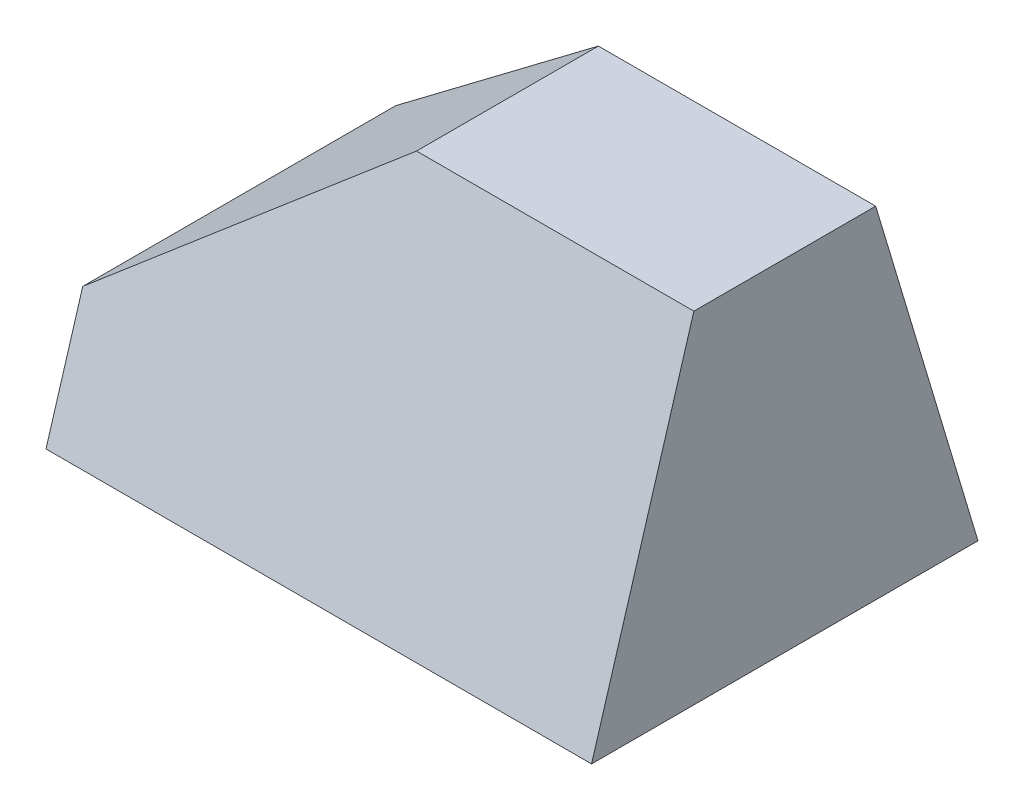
from build123d import *

# Parameters (mm, degrees)
EXTRUDE_1_DEPTH     = 120
CUT_EXTRUDE_2_DEPTH = 50


with BuildPart() as part:
    # Sketch 1 → Extrude 1 (new body)
    with BuildSketch(Plane(origin=(0, 0, 0), x_dir=(0, 0, -1), z_dir=(1, 0, 0))):
        Polygon((-42.5, 0), (42.5, 0), (20, 75), (-20, 75), align=None)
    extrude(amount=EXTRUDE_1_DEPTH)

    # Sketch 3 → Cut-Extrude 2 (cut, symmetric)
    with BuildSketch(Plane.XY):
        Polygon((70.262068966, 84.175862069), (-15.475862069, 14.327586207), (-15.475862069, 84.175862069), align=None)
    extrude(amount=CUT_EXTRUDE_2_DEPTH, both=True, mode=Mode.SUBTRACT)


solid = part.part
